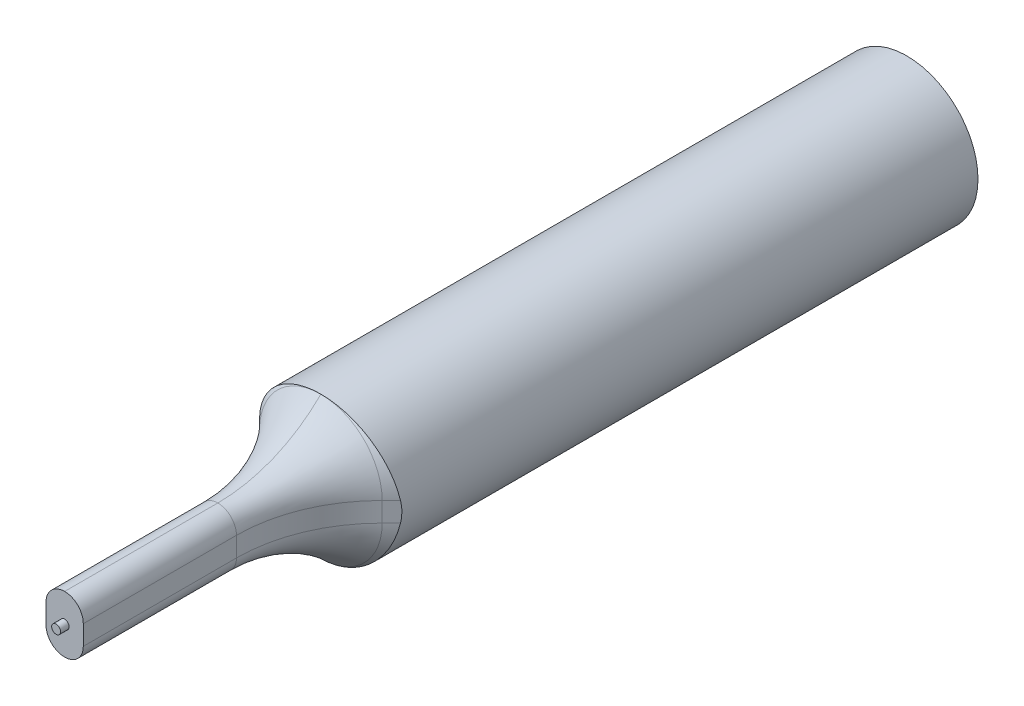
ISO-10303-21;
HEADER;
FILE_DESCRIPTION(('STEP AP214'),'2;1');
FILE_NAME('part.step','',(''),(''),'','','');
FILE_SCHEMA(('AUTOMOTIVE_DESIGN { 1 0 10303 214 1 1 1 1 }'));
ENDSEC;
DATA;
#1=APPLICATION_CONTEXT('core data for automotive mechanical design processes');
#2=APPLICATION_PROTOCOL_DEFINITION('international standard','automotive_design',2000,#1);
#3=PRODUCT_CONTEXT('',#1,'mechanical');
#4=PRODUCT('Part','Part','',(#3));
#5=PRODUCT_RELATED_PRODUCT_CATEGORY('part','',(#4));
#6=PRODUCT_DEFINITION_FORMATION('','',#4);
#7=PRODUCT_DEFINITION_CONTEXT('part definition',#1,'design');
#8=PRODUCT_DEFINITION('design','',#6,#7);
#9=PRODUCT_DEFINITION_SHAPE('','',#8);
#10=(LENGTH_UNIT() NAMED_UNIT(*) SI_UNIT(.MILLI.,.METRE.));
#11=(NAMED_UNIT(*) PLANE_ANGLE_UNIT() SI_UNIT($,.RADIAN.));
#12=(NAMED_UNIT(*) SI_UNIT($,.STERADIAN.) SOLID_ANGLE_UNIT());
#13=UNCERTAINTY_MEASURE_WITH_UNIT(LENGTH_MEASURE(1.E-05),#10,'distance_accuracy_value','');
#14=(GEOMETRIC_REPRESENTATION_CONTEXT(3) GLOBAL_UNCERTAINTY_ASSIGNED_CONTEXT((#13)) GLOBAL_UNIT_ASSIGNED_CONTEXT((#10,
#11,#12)) REPRESENTATION_CONTEXT('',''));
#15=CARTESIAN_POINT('',(0.,0.,0.));
#16=DIRECTION('',(0.,0.,1.));
#17=DIRECTION('',(1.,0.,0.));
#18=AXIS2_PLACEMENT_3D('',#15,#16,#17);
#19=CARTESIAN_POINT('',(0.,0.,43.5171681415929));
#20=DIRECTION('',(0.,0.,1.));
#21=DIRECTION('',(1.,0.,0.));
#22=AXIS2_PLACEMENT_3D('',#19,#20,#21);
#23=CYLINDRICAL_SURFACE('',#22,6.35);
#24=CARTESIAN_POINT('',(-5.92119806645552,-2.29388610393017,14.5772797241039));
#25=CARTESIAN_POINT('',(-5.92685944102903,-2.27926560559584,14.664229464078));
#26=CARTESIAN_POINT('',(-5.93180914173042,-2.26633597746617,14.7514987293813));
#27=CARTESIAN_POINT('',(-5.94033645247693,-2.2438922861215,14.9265393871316));
#28=CARTESIAN_POINT('',(-5.94391410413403,-2.23437811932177,15.0143107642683));
#29=CARTESIAN_POINT('',(-5.95266497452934,-2.21101194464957,15.2781402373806));
#30=CARTESIAN_POINT('',(-5.95585866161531,-2.20232951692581,15.4547537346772));
#31=CARTESIAN_POINT('',(-5.95713332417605,-2.19887735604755,15.808271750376));
#32=CARTESIAN_POINT('',(-5.95520968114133,-2.20412019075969,15.9851763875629));
#33=CARTESIAN_POINT('',(-5.94613941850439,-2.2284738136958,16.3378971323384));
#34=CARTESIAN_POINT('',(-5.93899290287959,-2.24758432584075,16.5137132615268));
#35=CARTESIAN_POINT('',(-5.91910627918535,-2.29944589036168,16.8631183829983));
#36=CARTESIAN_POINT('',(-5.90636256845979,-2.33220572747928,17.0367058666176));
#37=CARTESIAN_POINT('',(-5.87466187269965,-2.4109433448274,17.3802821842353));
#38=CARTESIAN_POINT('',(-5.85570495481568,-2.45692098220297,17.5502710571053));
#39=CARTESIAN_POINT('',(-5.81073647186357,-2.56145967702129,17.8852762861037));
#40=CARTESIAN_POINT('',(-5.78472884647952,-2.62001370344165,18.0502953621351));
#41=CARTESIAN_POINT('',(-5.72459450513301,-2.74892250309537,18.3741165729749));
#42=CARTESIAN_POINT('',(-5.69046940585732,-2.81927492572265,18.5329199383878));
#43=CARTESIAN_POINT('',(-5.61986464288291,-2.95710654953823,18.8149536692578));
#44=CARTESIAN_POINT('',(-5.58491850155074,-3.02281730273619,18.9394359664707));
#45=CARTESIAN_POINT('',(-5.50799919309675,-3.16080437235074,19.1824361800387));
#46=CARTESIAN_POINT('',(-5.4660273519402,-3.23307944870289,19.3009552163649));
#47=CARTESIAN_POINT('',(-5.37432201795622,-3.38332633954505,19.5310152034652));
#48=CARTESIAN_POINT('',(-5.32459680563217,-3.46129202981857,19.6425634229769));
#49=CARTESIAN_POINT('',(-5.21661165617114,-3.62199281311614,19.8577646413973));
#50=CARTESIAN_POINT('',(-5.15835353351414,-3.70472688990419,19.9614193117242));
#51=CARTESIAN_POINT('',(-4.99593631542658,-3.92312735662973,20.2175128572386));
#52=CARTESIAN_POINT('',(-4.88478345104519,-4.06160173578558,20.3632759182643));
#53=CARTESIAN_POINT('',(-4.63700310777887,-4.34230097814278,20.6273740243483));
#54=CARTESIAN_POINT('',(-4.50038307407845,-4.48452473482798,20.7457170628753));
#55=CARTESIAN_POINT('',(-4.27565364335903,-4.69596303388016,20.8989892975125));
#56=CARTESIAN_POINT('',(-4.19698126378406,-4.76648871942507,20.9462212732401));
#57=CARTESIAN_POINT('',(-4.03337301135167,-4.90570175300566,21.0316306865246));
#58=CARTESIAN_POINT('',(-3.9484405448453,-4.97439007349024,21.0698130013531));
#59=CARTESIAN_POINT('',(-3.77279273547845,-5.10889097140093,21.1364978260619));
#60=CARTESIAN_POINT('',(-3.68208130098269,-5.17470544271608,21.1650067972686));
#61=CARTESIAN_POINT('',(-3.49550107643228,-5.30252277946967,21.2118789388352));
#62=CARTESIAN_POINT('',(-3.39963330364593,-5.36452639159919,21.2302441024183));
#63=CARTESIAN_POINT('',(-3.21858077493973,-5.47473303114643,21.2544898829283));
#64=CARTESIAN_POINT('',(-3.13399371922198,-5.52359940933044,21.2618462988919));
#65=CARTESIAN_POINT('',(-2.96237292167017,-5.61750977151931,21.2689308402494));
#66=CARTESIAN_POINT('',(-2.87533843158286,-5.66255256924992,21.2686566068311));
#67=CARTESIAN_POINT('',(-2.69962249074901,-5.74839878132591,21.2604755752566));
#68=CARTESIAN_POINT('',(-2.61094216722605,-5.78920497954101,21.2525738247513));
#69=CARTESIAN_POINT('',(-2.4326256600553,-5.86636980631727,21.2292641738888));
#70=CARTESIAN_POINT('',(-2.34298912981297,-5.902726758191,21.2138534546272));
#71=CARTESIAN_POINT('',(-2.08553900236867,-6.0004230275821,21.1591250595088));
#72=CARTESIAN_POINT('',(-1.9173957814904,-6.05605791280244,21.1106667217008));
#73=CARTESIAN_POINT('',(-1.58524015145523,-6.15138004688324,20.9902758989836));
#74=CARTESIAN_POINT('',(-1.42122809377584,-6.19106594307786,20.918341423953));
#75=CARTESIAN_POINT('',(-1.088587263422,-6.25847170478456,20.7472192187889));
#76=CARTESIAN_POINT('',(-0.920593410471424,-6.28501921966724,20.6463455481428));
#77=CARTESIAN_POINT('',(-0.597190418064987,-6.32395902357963,20.4237842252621));
#78=CARTESIAN_POINT('',(-0.441791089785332,-6.33634037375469,20.30208057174));
#79=CARTESIAN_POINT('',(-0.187501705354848,-6.34812646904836,20.0777765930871));
#80=CARTESIAN_POINT('',(-0.0849723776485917,-6.35019396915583,19.9793689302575));
#81=CARTESIAN_POINT('',(0.111782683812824,-6.34977773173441,19.7745584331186));
#82=CARTESIAN_POINT('',(0.206005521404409,-6.34729241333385,19.668152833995));
#83=CARTESIAN_POINT('',(0.475713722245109,-6.33472006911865,19.3382514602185));
#84=CARTESIAN_POINT('',(0.638169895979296,-6.31951496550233,19.1041326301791));
#85=CARTESIAN_POINT('',(0.928257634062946,-6.28351284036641,18.6117275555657));
#86=CARTESIAN_POINT('',(1.05539044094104,-6.2626432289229,18.3531581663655));
#87=CARTESIAN_POINT('',(1.27161041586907,-6.22235044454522,17.8203731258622));
#88=CARTESIAN_POINT('',(1.36069139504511,-6.20292750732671,17.5461549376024));
#89=CARTESIAN_POINT('',(1.47178988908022,-6.17721932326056,17.1030731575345));
#90=CARTESIAN_POINT('',(1.50631693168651,-6.16881812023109,16.9373438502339));
#91=CARTESIAN_POINT('',(1.56221213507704,-6.154904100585,16.603492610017));
#92=CARTESIAN_POINT('',(1.58357746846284,-6.14939190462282,16.4353701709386));
#93=CARTESIAN_POINT('',(1.61312041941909,-6.14170742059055,16.0980450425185));
#94=CARTESIAN_POINT('',(1.62130870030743,-6.13953243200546,15.9288433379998));
#95=CARTESIAN_POINT('',(1.62453619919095,-6.13867960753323,15.5903682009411));
#96=CARTESIAN_POINT('',(1.61958144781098,-6.14000016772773,15.4210948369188));
#97=CARTESIAN_POINT('',(1.60032775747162,-6.14503963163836,15.1390605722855));
#98=CARTESIAN_POINT('',(1.58963793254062,-6.14782691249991,15.0260231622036));
#99=CARTESIAN_POINT('',(1.56236436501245,-6.15481026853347,14.8009072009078));
#100=CARTESIAN_POINT('',(1.54579100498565,-6.15900386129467,14.6888273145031));
#101=CARTESIAN_POINT('',(1.52626775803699,-6.16384674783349,14.5772797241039));
#102=B_SPLINE_CURVE_WITH_KNOTS('',3,(#24,#25,#26,#27,#28,#29,#30,#31,#32,#33,#34,#35,#36,#37,
#38,#39,#40,#41,#42,#43,#44,#45,#46,#47,#48,#49,#50,#51,#52,#53,#54,#55,#56,#57,#58,#59,#60,#61,
#62,#63,#64,#65,#66,#67,#68,#69,#70,#71,#72,#73,#74,#75,#76,#77,#78,#79,#80,#81,#82,#83,#84,#85,
#86,#87,#88,#89,#90,#91,#92,#93,#94,#95,#96,#97,#98,#99,#100,#101),.UNSPECIFIED.,.F.,.F.,(4,2,2,
2,2,2,2,2,2,2,2,2,2,2,2,2,2,2,2,2,2,2,2,2,2,2,2,2,2,2,2,2,2,2,2,2,2,2,4),(0.,0.265014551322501,
0.530021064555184,1.05991236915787,1.59028207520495,2.1206412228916,2.65134223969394,
3.18203752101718,3.71243687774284,4.24273068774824,4.67742509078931,5.11203754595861,
5.54618898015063,5.98024822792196,6.66667545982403,7.3529023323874,7.69964905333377,
8.04620846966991,8.39253594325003,8.73879534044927,9.03229993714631,9.32589526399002,
9.61929643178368,9.91280782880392,10.4610634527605,11.009365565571,11.6003612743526,
12.1918130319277,12.6176579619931,13.0436507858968,13.8959100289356,14.7596534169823,
15.6235372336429,16.1315475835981,16.6396670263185,17.1473750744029,17.6548502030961,
17.9954236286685,18.3353990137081),.UNSPECIFIED.);
#103=CARTESIAN_POINT('',(-5.9212110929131,-2.29385247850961,14.5774797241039));
#104=VERTEX_POINT('',#103);
#105=CARTESIAN_POINT('',(1.52630276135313,-6.16383808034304,14.5774797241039));
#106=VERTEX_POINT('',#105);
#107=EDGE_CURVE('E65',#104,#106,#102,.T.);
#108=ORIENTED_EDGE('',*,*,#107,.T.);
#109=CARTESIAN_POINT('',(1.52635511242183,-6.16382511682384,14.5776797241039));
#110=CARTESIAN_POINT('',(1.42396975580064,-6.18916413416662,14.18660833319));
#111=CARTESIAN_POINT('',(1.32068916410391,-6.21204658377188,13.7956089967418));
#112=CARTESIAN_POINT('',(1.11209743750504,-6.25276586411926,13.01384662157));
#113=CARTESIAN_POINT('',(1.00678609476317,-6.27060217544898,12.6230836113));
#114=CARTESIAN_POINT('',(0.793474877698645,-6.30115428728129,11.8403561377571));
#115=CARTESIAN_POINT('',(0.685465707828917,-6.31384867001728,11.4483933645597));
#116=CARTESIAN_POINT('',(0.466767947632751,-6.33377393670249,10.6651038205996));
#117=CARTESIAN_POINT('',(0.356079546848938,-6.34100520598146,10.273777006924));
#118=CARTESIAN_POINT('',(0.126364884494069,-6.34982899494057,9.47465869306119));
#119=CARTESIAN_POINT('',(0.00718664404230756,-6.3511568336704,9.06690779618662));
#120=CARTESIAN_POINT('',(-0.236063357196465,-6.34678061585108,8.25279047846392));
#121=CARTESIAN_POINT('',(-0.360136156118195,-6.34107505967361,7.84642437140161));
#122=CARTESIAN_POINT('',(-0.551430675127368,-6.32633219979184,7.23908602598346));
#123=CARTESIAN_POINT('',(-0.615995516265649,-6.32039578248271,7.03720040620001));
#124=CARTESIAN_POINT('',(-0.747338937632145,-6.3062157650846,6.63423413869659));
#125=CARTESIAN_POINT('',(-0.81411745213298,-6.29797223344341,6.4331534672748));
#126=CARTESIAN_POINT('',(-0.950478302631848,-6.27883983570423,6.03214796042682));
#127=CARTESIAN_POINT('',(-1.02005962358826,-6.26795192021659,5.8322227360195));
#128=CARTESIAN_POINT('',(-1.1629509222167,-6.24302186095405,5.43391533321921));
#129=CARTESIAN_POINT('',(-1.23626049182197,-6.22898006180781,5.23553298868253));
#130=CARTESIAN_POINT('',(-1.3652189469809,-6.20174230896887,4.90047757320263));
#131=CARTESIAN_POINT('',(-1.41953791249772,-6.18956506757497,4.76321207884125));
#132=CARTESIAN_POINT('',(-1.53153325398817,-6.16281037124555,4.4901914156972));
#133=CARTESIAN_POINT('',(-1.58921146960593,-6.14823159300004,4.35443712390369));
#134=CARTESIAN_POINT('',(-1.7090843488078,-6.11599462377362,4.08528915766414));
#135=CARTESIAN_POINT('',(-1.77127873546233,-6.09833662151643,3.95189533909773));
#136=CARTESIAN_POINT('',(-1.90206320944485,-6.05882418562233,3.68902720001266));
#137=CARTESIAN_POINT('',(-1.97064650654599,-6.03697418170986,3.55954890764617));
#138=CARTESIAN_POINT('',(-2.10333273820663,-5.99186254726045,3.33229045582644));
#139=CARTESIAN_POINT('',(-2.16565275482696,-5.96972871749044,3.23329403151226));
#140=CARTESIAN_POINT('',(-2.26642984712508,-5.93186755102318,3.0915698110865));
#141=CARTESIAN_POINT('',(-2.30113701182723,-5.9185118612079,3.04556964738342));
#142=CARTESIAN_POINT('',(-2.37368846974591,-5.88979058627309,2.95681554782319));
#143=CARTESIAN_POINT('',(-2.41152824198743,-5.87442787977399,2.91405709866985));
#144=CARTESIAN_POINT('',(-2.47961562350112,-5.84593359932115,2.84524426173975));
#145=CARTESIAN_POINT('',(-2.50886913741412,-5.83345327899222,2.8179493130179));
#146=CARTESIAN_POINT('',(-2.56976987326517,-5.80688287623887,2.76687069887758));
#147=CARTESIAN_POINT('',(-2.60142064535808,-5.79279038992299,2.74309240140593));
#148=CARTESIAN_POINT('',(-2.66772483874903,-5.76255928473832,2.70033534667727));
#149=CARTESIAN_POINT('',(-2.70241391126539,-5.74639492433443,2.68142797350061));
#150=CARTESIAN_POINT('',(-2.7740241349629,-5.71216634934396,2.65108246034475));
#151=CARTESIAN_POINT('',(-2.81093644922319,-5.69410946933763,2.63961663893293));
#152=CARTESIAN_POINT('',(-2.87633839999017,-5.66128629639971,2.62775964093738));
#153=CARTESIAN_POINT('',(-2.90461223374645,-5.64683417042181,2.62530878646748));
#154=CARTESIAN_POINT('',(-2.96089712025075,-5.61752555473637,2.62593215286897));
#155=CARTESIAN_POINT('',(-2.98890814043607,-5.6026690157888,2.62900704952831));
#156=CARTESIAN_POINT('',(-3.04373106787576,-5.57307544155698,2.64028786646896));
#157=CARTESIAN_POINT('',(-3.07054805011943,-5.55833817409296,2.64846928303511));
#158=CARTESIAN_POINT('',(-3.12266451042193,-5.52922775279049,2.66912591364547));
#159=CARTESIAN_POINT('',(-3.14796281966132,-5.51485488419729,2.68160438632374));
#160=CARTESIAN_POINT('',(-3.21497906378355,-5.47620563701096,2.72042366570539));
#161=CARTESIAN_POINT('',(-3.25500330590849,-5.4524663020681,2.75019138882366));
#162=CARTESIAN_POINT('',(-3.33047020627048,-5.40670211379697,2.81614957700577));
#163=CARTESIAN_POINT('',(-3.36589573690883,-5.38468378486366,2.85236292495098));
#164=CARTESIAN_POINT('',(-3.44628222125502,-5.33373411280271,2.94394434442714));
#165=CARTESIAN_POINT('',(-3.48947842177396,-5.30550979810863,3.00122630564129));
#166=CARTESIAN_POINT('',(-3.57068481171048,-5.25119873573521,3.12035990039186));
#167=CARTESIAN_POINT('',(-3.60868296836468,-5.22511700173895,3.18222164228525));
#168=CARTESIAN_POINT('',(-3.68100467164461,-5.1744240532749,3.30918822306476));
#169=CARTESIAN_POINT('',(-3.71530354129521,-5.14982314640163,3.37431104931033));
#170=CARTESIAN_POINT('',(-3.7808250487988,-5.10191115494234,3.50642041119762));
#171=CARTESIAN_POINT('',(-3.81205116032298,-5.07859862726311,3.5734047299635));
#172=CARTESIAN_POINT('',(-3.90848577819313,-5.00532201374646,3.79055854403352));
#173=CARTESIAN_POINT('',(-3.96912744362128,-4.9572180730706,3.94337224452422));
#174=CARTESIAN_POINT('',(-4.08300563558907,-4.86383852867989,4.25261185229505));
#175=CARTESIAN_POINT('',(-4.13623632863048,-4.81856516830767,4.40904049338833));
#176=CARTESIAN_POINT('',(-4.23746429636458,-4.72979269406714,4.72454171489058));
#177=CARTESIAN_POINT('',(-4.2854478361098,-4.68629841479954,4.88362003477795));
#178=CARTESIAN_POINT('',(-4.37730530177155,-4.60061216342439,5.20322980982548));
#179=CARTESIAN_POINT('',(-4.42118059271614,-4.55841976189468,5.36376076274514));
#180=CARTESIAN_POINT('',(-4.50573627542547,-4.4748606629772,5.68615655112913));
#181=CARTESIAN_POINT('',(-4.54641155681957,-4.43349536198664,5.84802308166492));
#182=CARTESIAN_POINT('',(-4.62506019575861,-4.35138402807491,6.17257780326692));
#183=CARTESIAN_POINT('',(-4.66303333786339,-4.31063804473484,6.33526605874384));
#184=CARTESIAN_POINT('',(-4.77342032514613,-4.18914803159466,6.82376858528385));
#185=CARTESIAN_POINT('',(-4.84242657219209,-4.10902715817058,7.15050850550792));
#186=CARTESIAN_POINT('',(-4.96709937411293,-3.95715585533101,7.77384603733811));
#187=CARTESIAN_POINT('',(-5.02341060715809,-3.88534541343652,8.07030213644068));
#188=CARTESIAN_POINT('',(-5.1312122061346,-3.74181890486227,8.66412028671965));
#189=CARTESIAN_POINT('',(-5.18270241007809,-3.67010284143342,8.96148236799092));
#190=CARTESIAN_POINT('',(-5.33097146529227,-3.4545278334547,9.85494974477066));
#191=CARTESIAN_POINT('',(-5.42146799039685,-3.31034189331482,10.452021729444));
#192=CARTESIAN_POINT('',(-5.58707169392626,-3.02227728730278,11.6371047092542));
#193=CARTESIAN_POINT('',(-5.66242009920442,-2.87843725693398,12.2250917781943));
#194=CARTESIAN_POINT('',(-5.76624907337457,-2.66069864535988,13.1073363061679));
#195=CARTESIAN_POINT('',(-5.79931221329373,-2.58782629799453,13.4013146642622));
#196=CARTESIAN_POINT('',(-5.86247393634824,-2.4413628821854,13.9894064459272));
#197=CARTESIAN_POINT('',(-5.89257256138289,-2.36777182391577,14.2835198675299));
#198=CARTESIAN_POINT('',(-5.9212305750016,-2.29380218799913,14.5776797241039));
#199=B_SPLINE_CURVE_WITH_KNOTS('',3,(#109,#110,#111,#112,#113,#114,#115,#116,#117,#118,#119,
#120,#121,#122,#123,#124,#125,#126,#127,#128,#129,#130,#131,#132,#133,#134,#135,#136,#137,#138,
#139,#140,#141,#142,#143,#144,#145,#146,#147,#148,#149,#150,#151,#152,#153,#154,#155,#156,#157,
#158,#159,#160,#161,#162,#163,#164,#165,#166,#167,#168,#169,#170,#171,#172,#173,#174,#175,#176,
#177,#178,#179,#180,#181,#182,#183,#184,#185,#186,#187,#188,#189,#190,#191,#192,#193,#194,#195,
#196,#197,#198),.UNSPECIFIED.,.F.,.F.,(4,2,2,2,2,2,2,2,2,2,2,2,2,2,2,2,2,2,2,2,2,2,2,2,2,2,2,2,
2,2,2,2,2,2,2,2,2,2,2,2,2,2,2,2,4),(0.,1.21513178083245,2.43038859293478,3.65065653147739,
4.87083839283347,6.14520896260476,7.41985129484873,8.05595690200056,8.69204363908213,
9.32790205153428,9.96369101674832,10.4080146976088,10.8525840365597,11.2971261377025,
11.7412010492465,12.0977164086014,12.2750382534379,12.4521085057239,12.5776622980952,
12.7034058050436,12.8308989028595,12.9579149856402,13.0529950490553,13.1480867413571,
13.2427256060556,13.3374363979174,13.5021919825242,13.6675445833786,13.8982470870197,
14.1294749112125,14.3621605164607,14.5945799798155,15.108044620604,15.6219111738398,
16.1370921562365,16.6521013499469,17.1679169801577,17.6837736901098,18.7139312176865,
19.6444424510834,20.5749849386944,22.4373710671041,24.2672221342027,25.1812335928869,
26.0952321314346),.UNSPECIFIED.);
#200=EDGE_CURVE('E11',#106,#104,#199,.T.);
#201=ORIENTED_EDGE('',*,*,#200,.T.);
#202=EDGE_LOOP('',(#108,#201));
#203=FACE_BOUND('',#202,.T.);
#204=CARTESIAN_POINT('',(0.,0.,52.9729685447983));
#205=DIRECTION('',(0.707106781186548,0.,-0.707106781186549));
#206=DIRECTION('',(0.707106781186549,0.,0.707106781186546));
#207=AXIS2_PLACEMENT_3D('',#204,#205,#206);
#208=ELLIPSE('',#207,8.98025612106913,6.35);
#209=CARTESIAN_POINT('',(-6.28942147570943,-0.875030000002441,46.6835470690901));
#210=VERTEX_POINT('',#209);
#211=CARTESIAN_POINT('',(-6.28942147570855,0.875029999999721,46.6835470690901));
#212=VERTEX_POINT('',#211);
#213=EDGE_CURVE('E156',#210,#212,#208,.T.);
#214=ORIENTED_EDGE('',*,*,#213,.T.);
#215=CARTESIAN_POINT('',(-6.28944929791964,0.874829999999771,46.6835192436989));
#216=CARTESIAN_POINT('',(-6.26821941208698,1.0275291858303,46.7047629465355));
#217=CARTESIAN_POINT('',(-6.24141002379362,1.17945045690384,46.7260076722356));
#218=CARTESIAN_POINT('',(-6.17681584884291,1.4809378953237,46.7683820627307));
#219=CARTESIAN_POINT('',(-6.13903242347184,1.63050435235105,46.7895117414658));
#220=CARTESIAN_POINT('',(-6.05263882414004,1.92662260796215,46.8315586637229));
#221=CARTESIAN_POINT('',(-6.00402124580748,2.07317226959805,46.8524757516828));
#222=CARTESIAN_POINT('',(-5.89621996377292,2.36239524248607,46.8939657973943));
#223=CARTESIAN_POINT('',(-5.83703512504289,2.5050681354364,46.9145387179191));
#224=CARTESIAN_POINT('',(-5.6976395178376,2.80924690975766,46.9586198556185));
#225=CARTESIAN_POINT('',(-5.61556790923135,2.96991622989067,46.9820441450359));
#226=CARTESIAN_POINT('',(-5.43796213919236,3.28384051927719,47.0280724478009));
#227=CARTESIAN_POINT('',(-5.34242229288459,3.43709232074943,47.050676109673));
#228=CARTESIAN_POINT('',(-5.1385867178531,3.7349680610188,47.0948525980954));
#229=CARTESIAN_POINT('',(-5.03029416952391,3.87959413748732,47.1164256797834));
#230=CARTESIAN_POINT('',(-4.80168286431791,4.15920102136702,47.15835198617));
#231=CARTESIAN_POINT('',(-4.68136393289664,4.29418168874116,47.1787051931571));
#232=CARTESIAN_POINT('',(-4.430235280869,4.55278167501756,47.217890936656));
#233=CARTESIAN_POINT('',(-4.29948701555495,4.67645949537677,47.2367312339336));
#234=CARTESIAN_POINT('',(-4.02783871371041,4.9123697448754,47.2728315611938));
#235=CARTESIAN_POINT('',(-3.88693867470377,5.0246021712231,47.2900915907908));
#236=CARTESIAN_POINT('',(-3.59593098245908,5.23681399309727,47.3228616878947));
#237=CARTESIAN_POINT('',(-3.44582031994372,5.33678935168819,47.3383711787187));
#238=CARTESIAN_POINT('',(-3.13750658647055,5.52368056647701,47.3674697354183));
#239=CARTESIAN_POINT('',(-2.97930379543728,5.61059687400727,47.3810588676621));
#240=CARTESIAN_POINT('',(-2.65753461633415,5.76991523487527,47.4060453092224));
#241=CARTESIAN_POINT('',(-2.49403638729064,5.84245178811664,47.4174628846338));
#242=CARTESIAN_POINT('',(-2.16144855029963,5.97348913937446,47.4381406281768));
#243=CARTESIAN_POINT('',(-1.99236115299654,6.03199541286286,47.447401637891));
#244=CARTESIAN_POINT('',(-1.64993666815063,6.13450230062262,47.4636585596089));
#245=CARTESIAN_POINT('',(-1.4766042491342,6.17851814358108,47.4706568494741));
#246=CARTESIAN_POINT('',(-1.12683749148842,6.25177111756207,47.4823185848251));
#247=CARTESIAN_POINT('',(-0.950404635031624,6.2810151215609,47.4869831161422));
#248=CARTESIAN_POINT('',(-0.644717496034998,6.31850948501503,47.492967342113));
#249=CARTESIAN_POINT('',(-0.515900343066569,6.33032817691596,47.494855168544));
#250=CARTESIAN_POINT('',(-0.257992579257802,6.34607074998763,47.4973705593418));
#251=CARTESIAN_POINT('',(-0.128902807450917,6.35000803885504,47.4980002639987));
#252=CARTESIAN_POINT('',(0.000199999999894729,6.34999999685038,47.4979985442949));
#253=B_SPLINE_CURVE_WITH_KNOTS('',3,(#215,#216,#217,#218,#219,#220,#221,#222,#223,#224,#225,
#226,#227,#228,#229,#230,#231,#232,#233,#234,#235,#236,#237,#238,#239,#240,#241,#242,#243,#244,
#245,#246,#247,#248,#249,#250,#251,#252),.UNSPECIFIED.,.F.,.F.,(4,2,2,2,2,2,2,2,2,2,2,2,2,2,2,2,
2,2,4),(0.,0.466769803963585,0.933481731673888,1.40051360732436,1.86759567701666,
2.41272364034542,2.95808239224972,3.5033054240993,4.04853637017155,4.59076317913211,
5.13299012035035,5.67539517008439,6.21778146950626,6.75482664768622,7.29166189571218,
7.82793114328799,8.36395064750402,8.75183188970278,9.13905271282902),.UNSPECIFIED.);
#254=CARTESIAN_POINT('',(0.,6.34999999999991,47.4979985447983));
#255=VERTEX_POINT('',#254);
#256=EDGE_CURVE('E213',#212,#255,#253,.T.);
#257=ORIENTED_EDGE('',*,*,#256,.T.);
#258=CARTESIAN_POINT('',(-0.000200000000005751,6.34999999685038,47.4979985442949));
#259=CARTESIAN_POINT('',(0.176360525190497,6.35002569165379,47.4980042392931));
#260=CARTESIAN_POINT('',(0.352917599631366,6.34264813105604,47.4968235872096));
#261=CARTESIAN_POINT('',(0.70476185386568,6.3132324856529,47.4921244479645));
#262=CARTESIAN_POINT('',(0.880049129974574,6.29119552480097,47.4886061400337));
#263=CARTESIAN_POINT('',(1.22793484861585,6.23263789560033,47.4792714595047));
#264=CARTESIAN_POINT('',(1.40053593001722,6.19613251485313,47.4734575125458));
#265=CARTESIAN_POINT('',(1.74201893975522,6.10892127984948,47.4595987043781));
#266=CARTESIAN_POINT('',(1.9109008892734,6.05821550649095,47.4515538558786));
#267=CARTESIAN_POINT('',(2.24389774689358,5.94293645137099,47.4333146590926));
#268=CARTESIAN_POINT('',(2.40800866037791,5.87835190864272,47.4231185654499));
#269=CARTESIAN_POINT('',(2.7302360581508,5.73579641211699,47.4006875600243));
#270=CARTESIAN_POINT('',(2.88835032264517,5.65782055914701,47.388451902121));
#271=CARTESIAN_POINT('',(3.19737464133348,5.48910510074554,47.3620784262));
#272=CARTESIAN_POINT('',(3.34828724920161,5.39837006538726,47.3479412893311));
#273=CARTESIAN_POINT('',(3.64194340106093,5.20477453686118,47.3179057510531));
#274=CARTESIAN_POINT('',(3.78468668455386,5.10191365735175,47.3020072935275));
#275=CARTESIAN_POINT('',(4.06213569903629,4.88394536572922,47.2684735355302));
#276=CARTESIAN_POINT('',(4.19676847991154,4.76874706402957,47.2508254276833));
#277=CARTESIAN_POINT('',(4.45583722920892,4.52761859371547,47.2140701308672));
#278=CARTESIAN_POINT('',(4.58027315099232,4.40168837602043,47.1949629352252));
#279=CARTESIAN_POINT('',(4.81817650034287,4.13992412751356,47.1554560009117));
#280=CARTESIAN_POINT('',(4.93163793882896,4.00408475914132,47.1350555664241));
#281=CARTESIAN_POINT('',(5.14675754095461,3.72352448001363,47.09315348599));
#282=CARTESIAN_POINT('',(5.24841582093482,3.57880365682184,47.0716518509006));
#283=CARTESIAN_POINT('',(5.4404115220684,3.27969286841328,47.0274650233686));
#284=CARTESIAN_POINT('',(5.530597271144,3.12520718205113,47.0047686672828));
#285=CARTESIAN_POINT('',(5.69755089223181,2.80932639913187,46.9586340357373));
#286=CARTESIAN_POINT('',(5.77432359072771,2.64793381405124,46.9351960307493));
#287=CARTESIAN_POINT('',(5.91388835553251,2.31953048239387,46.887788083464));
#288=CARTESIAN_POINT('',(5.97669731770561,2.15252681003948,46.8638188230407));
#289=CARTESIAN_POINT('',(6.08800772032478,1.81394421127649,46.8155137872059));
#290=CARTESIAN_POINT('',(6.13651637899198,1.64236764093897,46.7911782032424));
#291=CARTESIAN_POINT('',(6.20106716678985,1.37093261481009,46.7529078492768));
#292=CARTESIAN_POINT('',(6.22206878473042,1.27221853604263,46.739036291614));
#293=CARTESIAN_POINT('',(6.25931654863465,1.07405940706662,46.7112833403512));
#294=CARTESIAN_POINT('',(6.27556998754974,0.974615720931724,46.6974019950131));
#295=CARTESIAN_POINT('',(6.28944929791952,0.874829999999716,46.6835192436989));
#296=B_SPLINE_CURVE_WITH_KNOTS('',3,(#258,#259,#260,#261,#262,#263,#264,#265,#266,#267,#268,
#269,#270,#271,#272,#273,#274,#275,#276,#277,#278,#279,#280,#281,#282,#283,#284,#285,#286,#287,
#288,#289,#290,#291,#292,#293,#294,#295),.UNSPECIFIED.,.F.,.F.,(4,2,2,2,2,2,2,2,2,2,2,2,2,2,2,2,
2,2,4),(0.,0.529517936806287,1.05899527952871,1.58791465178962,2.116831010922,2.64617815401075,
3.1757193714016,3.7050713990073,4.23444029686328,4.76801920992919,5.30160056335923,
5.83547148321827,6.36933714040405,6.90965505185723,7.44977813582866,7.98924408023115,
8.52843725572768,8.83395232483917,9.13899564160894),.UNSPECIFIED.);
#297=CARTESIAN_POINT('',(6.28942147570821,0.875029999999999,46.6835470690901));
#298=VERTEX_POINT('',#297);
#299=EDGE_CURVE('E162',#255,#298,#296,.T.);
#300=ORIENTED_EDGE('',*,*,#299,.T.);
#301=CARTESIAN_POINT('',(0.,0.,52.9729685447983));
#302=DIRECTION('',(-0.707106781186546,0.,-0.707106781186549));
#303=DIRECTION('',(-0.707106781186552,0.,0.707106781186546));
#304=AXIS2_PLACEMENT_3D('',#301,#302,#303);
#305=ELLIPSE('',#304,8.98025612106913,6.35);
#306=CARTESIAN_POINT('',(6.28942147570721,-0.875030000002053,46.6835470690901));
#307=VERTEX_POINT('',#306);
#308=EDGE_CURVE('E169',#298,#307,#305,.T.);
#309=ORIENTED_EDGE('',*,*,#308,.T.);
#310=CARTESIAN_POINT('',(6.28944929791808,-0.874830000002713,46.6835192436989));
#311=CARTESIAN_POINT('',(6.26821940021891,-1.02752927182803,46.7047629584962));
#312=CARTESIAN_POINT('',(6.24140999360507,-1.17945062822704,46.7260076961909));
#313=CARTESIAN_POINT('',(6.17681577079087,-1.48093822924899,46.7683821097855));
#314=CARTESIAN_POINT('',(6.13903231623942,-1.63050476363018,46.7895117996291));
#315=CARTESIAN_POINT('',(6.0526386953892,-1.92662300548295,46.8315587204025));
#316=CARTESIAN_POINT('',(6.0040211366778,-2.0731725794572,46.8524757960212));
#317=CARTESIAN_POINT('',(5.89621990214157,-2.36239539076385,46.8939658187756));
#318=CARTESIAN_POINT('',(5.83703509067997,-2.50506820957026,46.9145387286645));
#319=CARTESIAN_POINT('',(5.69764127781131,-2.80924307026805,46.9586192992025));
#320=CARTESIAN_POINT('',(5.61557175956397,-2.96990869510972,46.9820430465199));
#321=CARTESIAN_POINT('',(5.43797067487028,-3.28382616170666,47.0280703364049));
#322=CARTESIAN_POINT('',(5.34243340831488,-3.43707482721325,47.0506735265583));
#323=CARTESIAN_POINT('',(5.13861704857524,-3.73492498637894,47.0948461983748));
#324=CARTESIAN_POINT('',(5.03034282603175,-3.87952975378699,47.116416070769));
#325=CARTESIAN_POINT('',(4.80173110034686,-4.15914689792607,47.1583438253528));
#326=CARTESIAN_POINT('',(4.68138915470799,-4.29415571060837,47.1787012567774));
#327=CARTESIAN_POINT('',(4.43024123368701,-4.55277555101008,47.2178900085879));
#328=CARTESIAN_POINT('',(4.29949947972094,-4.67644771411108,47.2367294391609));
#329=CARTESIAN_POINT('',(4.02781474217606,-4.91239151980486,47.2728348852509));
#330=CARTESIAN_POINT('',(3.88686799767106,-5.02465892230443,47.2901003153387));
#331=CARTESIAN_POINT('',(3.59585746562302,-5.23686239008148,47.322869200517));
#332=CARTESIAN_POINT('',(3.44579671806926,-5.33680253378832,47.338373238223));
#333=CARTESIAN_POINT('',(3.13752643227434,-5.52366966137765,47.3674680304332));
#334=CARTESIAN_POINT('',(2.97931393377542,-5.61059187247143,47.3810580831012));
#335=CARTESIAN_POINT('',(2.65770572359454,-5.76983049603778,47.4060320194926));
#336=CARTESIAN_POINT('',(2.49438589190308,-5.8422966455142,47.4174384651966));
#337=CARTESIAN_POINT('',(2.16204040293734,-5.97327334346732,47.4381065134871));
#338=CARTESIAN_POINT('',(1.99301267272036,-6.0317787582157,47.447367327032));
#339=CARTESIAN_POINT('',(1.6505744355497,-6.13433290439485,47.4636316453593));
#340=CARTESIAN_POINT('',(1.47716522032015,-6.17838584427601,47.4706358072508));
#341=CARTESIAN_POINT('',(1.12716967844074,-6.25171631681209,47.4823098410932));
#342=CARTESIAN_POINT('',(0.950583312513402,-6.28099366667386,47.4869796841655));
#343=CARTESIAN_POINT('',(0.59738311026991,-6.32431487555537,47.493893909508));
#344=CARTESIAN_POINT('',(0.42078890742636,-6.33851497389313,47.4961631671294));
#345=CARTESIAN_POINT('',(0.0670176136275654,-6.35211325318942,47.4983361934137));
#346=CARTESIAN_POINT('',(-0.110159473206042,-6.3515115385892,47.4982399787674));
#347=CARTESIAN_POINT('',(-0.463824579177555,-6.33551105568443,47.4956832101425));
#348=CARTESIAN_POINT('',(-0.640312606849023,-6.32011247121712,47.4932226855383));
#349=CARTESIAN_POINT('',(-0.99133505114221,-6.27463746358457,47.4859658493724));
#350=CARTESIAN_POINT('',(-1.16586950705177,-6.24456133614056,47.4811695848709));
#351=CARTESIAN_POINT('',(-1.51111931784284,-6.17009658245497,47.469317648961));
#352=CARTESIAN_POINT('',(-1.68184617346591,-6.12575995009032,47.462270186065));
#353=CARTESIAN_POINT('',(-2.01886508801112,-6.02309745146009,47.4459927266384));
#354=CARTESIAN_POINT('',(-2.18515873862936,-5.96477668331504,47.4367635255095));
#355=CARTESIAN_POINT('',(-2.51227751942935,-5.83454925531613,47.4162184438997));
#356=CARTESIAN_POINT('',(-2.67310055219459,-5.76263745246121,47.4049017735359));
#357=CARTESIAN_POINT('',(-2.98804305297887,-5.60580364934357,47.3803094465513));
#358=CARTESIAN_POINT('',(-3.1421648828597,-5.52088628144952,47.3670344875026));
#359=CARTESIAN_POINT('',(-3.44357950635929,-5.33811790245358,47.338578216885));
#360=CARTESIAN_POINT('',(-3.59082776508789,-5.24019509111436,47.3233863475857));
#361=CARTESIAN_POINT('',(-3.8764791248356,-5.03255175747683,47.2913167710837));
#362=CARTESIAN_POINT('',(-4.0148853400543,-4.92283542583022,47.2744396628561));
#363=CARTESIAN_POINT('',(-4.2820333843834,-4.69231614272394,47.2391518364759));
#364=CARTESIAN_POINT('',(-4.41077083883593,-4.57150822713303,47.22074043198));
#365=CARTESIAN_POINT('',(-4.65760533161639,-4.31975454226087,47.1825702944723));
#366=CARTESIAN_POINT('',(-4.77570609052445,-4.18881234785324,47.1628120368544));
#367=CARTESIAN_POINT('',(-5.00182988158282,-3.91611173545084,47.1218857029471));
#368=CARTESIAN_POINT('',(-5.10972121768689,-3.77424613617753,47.1007040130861));
#369=CARTESIAN_POINT('',(-5.3131032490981,-3.48211177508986,47.0573330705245));
#370=CARTESIAN_POINT('',(-5.40859824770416,-3.33184595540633,47.0351441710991));
#371=CARTESIAN_POINT('',(-5.58657857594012,-3.02394562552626,46.9899424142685));
#372=CARTESIAN_POINT('',(-5.66906620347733,-2.86631242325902,46.9669297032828));
#373=CARTESIAN_POINT('',(-5.8204769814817,-2.54482400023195,46.9202726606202));
#374=CARTESIAN_POINT('',(-5.88940338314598,-2.3809702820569,46.8966284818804));
#375=CARTESIAN_POINT('',(-6.03188982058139,-1.99802383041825,46.8416980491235));
#376=CARTESIAN_POINT('',(-6.10062071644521,-1.77712483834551,46.8102499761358));
#377=CARTESIAN_POINT('',(-6.18530067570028,-1.44148346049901,46.7628360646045));
#378=CARTESIAN_POINT('',(-6.21044824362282,-1.32895711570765,46.7470008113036));
#379=CARTESIAN_POINT('',(-6.25458132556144,-1.1027167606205,46.7152845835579));
#380=CARTESIAN_POINT('',(-6.27356725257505,-0.989002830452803,46.6994036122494));
#381=CARTESIAN_POINT('',(-6.2894492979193,-0.874830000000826,46.6835192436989));
#382=B_SPLINE_CURVE_WITH_KNOTS('',3,(#310,#311,#312,#313,#314,#315,#316,#317,#318,#319,#320,
#321,#322,#323,#324,#325,#326,#327,#328,#329,#330,#331,#332,#333,#334,#335,#336,#337,#338,#339,
#340,#341,#342,#343,#344,#345,#346,#347,#348,#349,#350,#351,#352,#353,#354,#355,#356,#357,#358,
#359,#360,#361,#362,#363,#364,#365,#366,#367,#368,#369,#370,#371,#372,#373,#374,#375,#376,#377,
#378,#379,#380,#381),.UNSPECIFIED.,.F.,.F.,(4,2,2,2,2,2,2,2,2,2,2,2,2,2,2,2,2,2,2,2,2,2,2,2,2,2,
2,2,2,2,2,2,2,2,2,4),(0.,0.466770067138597,0.933482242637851,1.40051384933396,1.86759567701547,
2.41271086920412,2.95805747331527,3.50319620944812,4.04853636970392,4.59073739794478,
5.13313927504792,5.67536121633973,6.21778146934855,6.75425258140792,7.29092066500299,
7.82743233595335,8.36395064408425,8.89485329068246,9.42575219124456,9.9566444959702,
10.4875261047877,11.0164936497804,11.5452686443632,12.0742441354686,12.6030316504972,
13.1348702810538,13.6665205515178,14.1984099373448,14.7301125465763,15.267937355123,
15.8055749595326,16.3431174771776,16.8805309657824,17.5794003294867,17.9284116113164,
18.2773994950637),.UNSPECIFIED.);
#383=EDGE_CURVE('E204',#307,#210,#382,.T.);
#384=ORIENTED_EDGE('',*,*,#383,.T.);
#385=EDGE_LOOP('',(#214,#257,#300,#309,#384));
#386=FACE_BOUND('',#385,.T.);
#387=CARTESIAN_POINT('',(0.,0.,-4.77519999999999));
#388=DIRECTION('',(0.,0.,1.));
#389=DIRECTION('',(1.,0.,0.));
#390=AXIS2_PLACEMENT_3D('',#387,#388,#389);
#391=CIRCLE('',#390,6.35);
#392=CARTESIAN_POINT('',(6.35000000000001,0.,-4.77519999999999));
#393=VERTEX_POINT('',#392);
#394=EDGE_CURVE('E159',#393,#393,#391,.T.);
#395=ORIENTED_EDGE('',*,*,#394,.T.);
#396=EDGE_LOOP('',(#395));
#397=FACE_BOUND('',#396,.T.);
#398=ADVANCED_FACE('F51',(#203,#386,#397),#23,.T.);
#399=CARTESIAN_POINT('',(-6.35000000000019,-4.44089209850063E-13,-4.77519999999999));
#400=DIRECTION('',(0.,0.,1.));
#401=DIRECTION('',(1.,0.,0.));
#402=AXIS2_PLACEMENT_3D('',#399,#400,#401);
#403=PLANE('',#402);
#404=ORIENTED_EDGE('',*,*,#394,.F.);
#405=EDGE_LOOP('',(#404));
#406=FACE_BOUND('',#405,.T.);
#407=ADVANCED_FACE('F151',(#406),#403,.F.);
#408=CARTESIAN_POINT('',(-1.11022302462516E-13,0.875029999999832,47.5016567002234));
#409=DIRECTION('',(0.,0.,-1.));
#410=DIRECTION('',(-1.,0.,0.));
#411=AXIS2_PLACEMENT_3D('',#408,#409,#410);
#412=CONICAL_SURFACE('',#411,5.47131184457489,0.78539816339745);
#413=DIRECTION('',(-0.707106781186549,0.,-0.707106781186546));
#414=VECTOR('',#413,1.);
#415=CARTESIAN_POINT('',(-5.47131184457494,0.875029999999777,47.5016567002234));
#416=LINE('',#415,#414);
#417=CARTESIAN_POINT('',(-5.47131184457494,0.875029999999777,47.5016567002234));
#418=VERTEX_POINT('',#417);
#419=EDGE_CURVE('E174',#418,#212,#416,.T.);
#420=ORIENTED_EDGE('',*,*,#419,.F.);
#421=CARTESIAN_POINT('',(-1.11022302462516E-13,0.875029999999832,47.5016567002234));
#422=DIRECTION('',(0.,0.,-1.));
#423=DIRECTION('',(-1.,0.,0.));
#424=AXIS2_PLACEMENT_3D('',#421,#422,#423);
#425=CIRCLE('',#424,5.47131184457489);
#426=CARTESIAN_POINT('',(-1.22124532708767E-12,6.34634184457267,47.5016567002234));
#427=VERTEX_POINT('',#426);
#428=EDGE_CURVE('E163',#418,#427,#425,.T.);
#429=ORIENTED_EDGE('',*,*,#428,.T.);
#430=DIRECTION('',(0.,0.707106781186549,-0.707106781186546));
#431=VECTOR('',#430,1.);
#432=CARTESIAN_POINT('',(-1.22124532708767E-12,6.34634184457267,47.5016567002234));
#433=LINE('',#432,#431);
#434=EDGE_CURVE('E420',#427,#255,#433,.T.);
#435=ORIENTED_EDGE('',*,*,#434,.T.);
#436=ORIENTED_EDGE('',*,*,#256,.F.);
#437=EDGE_LOOP('',(#420,#429,#435,#436));
#438=FACE_BOUND('',#437,.T.);
#439=ADVANCED_FACE('F220',(#438),#412,.T.);
#440=CARTESIAN_POINT('',(-5.47131184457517,-0.875030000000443,47.5016567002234));
#441=DIRECTION('',(0.707106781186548,0.,-0.707106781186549));
#442=DIRECTION('',(-0.707106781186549,0.,-0.707106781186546));
#443=AXIS2_PLACEMENT_3D('',#440,#441,#442);
#444=PLANE('',#443);
#445=DIRECTION('',(-0.707106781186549,0.,-0.707106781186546));
#446=VECTOR('',#445,1.);
#447=CARTESIAN_POINT('',(-5.47131184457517,-0.875030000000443,47.5016567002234));
#448=LINE('',#447,#446);
#449=CARTESIAN_POINT('',(-5.47131184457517,-0.875030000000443,47.5016567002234));
#450=VERTEX_POINT('',#449);
#451=EDGE_CURVE('E437',#450,#210,#448,.T.);
#452=ORIENTED_EDGE('',*,*,#451,.F.);
#453=DIRECTION('',(0.,1.,0.));
#454=VECTOR('',#453,1.);
#455=CARTESIAN_POINT('',(-5.47131184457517,-0.875030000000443,47.5016567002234));
#456=LINE('',#455,#454);
#457=EDGE_CURVE('E500',#450,#418,#456,.T.);
#458=ORIENTED_EDGE('',*,*,#457,.T.);
#459=ORIENTED_EDGE('',*,*,#419,.T.);
#460=ORIENTED_EDGE('',*,*,#213,.F.);
#461=EDGE_LOOP('',(#452,#458,#459,#460));
#462=FACE_BOUND('',#461,.T.);
#463=ADVANCED_FACE('F201',(#462),#444,.F.);
#464=CARTESIAN_POINT('',(-1.22124532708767E-12,-0.875030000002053,47.5016567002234));
#465=DIRECTION('',(0.,0.,-1.));
#466=DIRECTION('',(-1.,0.,0.));
#467=AXIS2_PLACEMENT_3D('',#464,#465,#466);
#468=CONICAL_SURFACE('',#467,5.47131184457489,0.78539816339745);
#469=DIRECTION('',(0.707106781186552,0.,-0.707106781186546));
#470=VECTOR('',#469,1.);
#471=CARTESIAN_POINT('',(5.47131184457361,-0.875030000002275,47.5016567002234));
#472=LINE('',#471,#470);
#473=CARTESIAN_POINT('',(5.47131184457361,-0.875030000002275,47.5016567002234));
#474=VERTEX_POINT('',#473);
#475=EDGE_CURVE('E431',#474,#307,#472,.T.);
#476=ORIENTED_EDGE('',*,*,#475,.F.);
#477=CARTESIAN_POINT('',(-1.22124532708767E-12,-0.875030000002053,47.5016567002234));
#478=DIRECTION('',(0.,0.,-1.));
#479=DIRECTION('',(1.,0.,0.));
#480=AXIS2_PLACEMENT_3D('',#477,#478,#479);
#481=CIRCLE('',#480,5.47131184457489);
#482=EDGE_CURVE('E462',#474,#450,#481,.T.);
#483=ORIENTED_EDGE('',*,*,#482,.T.);
#484=ORIENTED_EDGE('',*,*,#451,.T.);
#485=ORIENTED_EDGE('',*,*,#383,.F.);
#486=EDGE_LOOP('',(#476,#483,#484,#485));
#487=FACE_BOUND('',#486,.T.);
#488=ADVANCED_FACE('F196',(#487),#468,.T.);
#489=CARTESIAN_POINT('',(5.47131184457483,0.875029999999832,47.5016567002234));
#490=DIRECTION('',(-0.707106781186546,0.,-0.707106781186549));
#491=DIRECTION('',(-0.707106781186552,0.,0.707106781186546));
#492=AXIS2_PLACEMENT_3D('',#489,#490,#491);
#493=PLANE('',#492);
#494=DIRECTION('',(0.707106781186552,0.,-0.707106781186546));
#495=VECTOR('',#494,1.);
#496=CARTESIAN_POINT('',(5.47131184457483,0.875029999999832,47.5016567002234));
#497=LINE('',#496,#495);
#498=CARTESIAN_POINT('',(5.47131184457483,0.875029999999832,47.5016567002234));
#499=VERTEX_POINT('',#498);
#500=EDGE_CURVE('E426',#499,#298,#497,.T.);
#501=ORIENTED_EDGE('',*,*,#500,.F.);
#502=DIRECTION('',(0.,-1.,0.));
#503=VECTOR('',#502,1.);
#504=CARTESIAN_POINT('',(5.47131184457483,0.875029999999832,47.5016567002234));
#505=LINE('',#504,#503);
#506=EDGE_CURVE('E488',#499,#474,#505,.T.);
#507=ORIENTED_EDGE('',*,*,#506,.T.);
#508=ORIENTED_EDGE('',*,*,#475,.T.);
#509=ORIENTED_EDGE('',*,*,#308,.F.);
#510=EDGE_LOOP('',(#501,#507,#508,#509));
#511=FACE_BOUND('',#510,.T.);
#512=ADVANCED_FACE('F191',(#511),#493,.F.);
#513=CARTESIAN_POINT('',(-1.11022302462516E-13,0.875029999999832,47.5016567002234));
#514=DIRECTION('',(0.,0.,-1.));
#515=DIRECTION('',(-1.,0.,0.));
#516=AXIS2_PLACEMENT_3D('',#513,#514,#515);
#517=CONICAL_SURFACE('',#516,5.4713118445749,0.78539816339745);
#518=ORIENTED_EDGE('',*,*,#434,.F.);
#519=CARTESIAN_POINT('',(-1.11022302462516E-13,0.875029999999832,47.5016567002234));
#520=DIRECTION('',(0.,0.,-1.));
#521=DIRECTION('',(0.,1.,0.));
#522=AXIS2_PLACEMENT_3D('',#519,#520,#521);
#523=CIRCLE('',#522,5.47131184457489);
#524=EDGE_CURVE('E481',#427,#499,#523,.T.);
#525=ORIENTED_EDGE('',*,*,#524,.T.);
#526=ORIENTED_EDGE('',*,*,#500,.T.);
#527=ORIENTED_EDGE('',*,*,#299,.F.);
#528=EDGE_LOOP('',(#518,#525,#526,#527));
#529=FACE_BOUND('',#528,.T.);
#530=ADVANCED_FACE('F185',(#529),#517,.T.);
#531=CARTESIAN_POINT('',(-1.11022302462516E-13,0.875029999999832,56.6940448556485));
#532=DIRECTION('',(0.,0.,-1.));
#533=DIRECTION('',(-1.,0.,0.));
#534=AXIS2_PLACEMENT_3D('',#531,#532,#533);
#535=TOROIDAL_SURFACE('',#534,14.6637,13.);
#536=CARTESIAN_POINT('',(-1.11022302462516E-13,0.875029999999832,56.6940448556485));
#537=DIRECTION('',(0.,0.,-1.));
#538=DIRECTION('',(-1.,0.,0.));
#539=AXIS2_PLACEMENT_3D('',#536,#537,#538);
#540=CIRCLE('',#539,1.6637);
#541=CARTESIAN_POINT('',(-1.66370000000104,0.875029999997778,56.6940448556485));
#542=VERTEX_POINT('',#541);
#543=CARTESIAN_POINT('',(0.,2.53872999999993,56.6940448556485));
#544=VERTEX_POINT('',#543);
#545=EDGE_CURVE('E171',#542,#544,#540,.T.);
#546=ORIENTED_EDGE('',*,*,#545,.T.);
#547=CARTESIAN_POINT('',(0.,15.5387299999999,56.6940448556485));
#548=DIRECTION('',(1.,0.,0.));
#549=DIRECTION('',(0.,0.,-1.));
#550=AXIS2_PLACEMENT_3D('',#547,#548,#549);
#551=CIRCLE('',#550,13.);
#552=EDGE_CURVE('E413',#544,#427,#551,.T.);
#553=ORIENTED_EDGE('',*,*,#552,.T.);
#554=ORIENTED_EDGE('',*,*,#428,.F.);
#555=CARTESIAN_POINT('',(-14.6636999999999,0.875029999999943,56.6940448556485));
#556=DIRECTION('',(0.,1.,0.));
#557=DIRECTION('',(0.,0.,-1.));
#558=AXIS2_PLACEMENT_3D('',#555,#556,#557);
#559=CIRCLE('',#558,13.);
#560=EDGE_CURVE('E472',#542,#418,#559,.T.);
#561=ORIENTED_EDGE('',*,*,#560,.F.);
#562=EDGE_LOOP('',(#546,#553,#554,#561));
#563=FACE_BOUND('',#562,.T.);
#564=ADVANCED_FACE('F190',(#563),#535,.F.);
#565=CARTESIAN_POINT('',(-1.11022302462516E-13,0.875029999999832,70.358));
#566=DIRECTION('',(0.,0.,-1.));
#567=DIRECTION('',(-1.,0.,0.));
#568=AXIS2_PLACEMENT_3D('',#565,#566,#567);
#569=CYLINDRICAL_SURFACE('',#568,1.6637);
#570=CARTESIAN_POINT('',(-1.11022302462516E-13,0.875029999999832,70.358));
#571=DIRECTION('',(0.,0.,-1.));
#572=DIRECTION('',(-1.,0.,0.));
#573=AXIS2_PLACEMENT_3D('',#570,#571,#572);
#574=CIRCLE('',#573,1.6637);
#575=CARTESIAN_POINT('',(-1.66370000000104,0.875029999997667,70.358));
#576=VERTEX_POINT('',#575);
#577=CARTESIAN_POINT('',(0.,2.53872999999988,70.358));
#578=VERTEX_POINT('',#577);
#579=EDGE_CURVE('E438',#576,#578,#574,.T.);
#580=ORIENTED_EDGE('',*,*,#579,.T.);
#581=DIRECTION('',(0.,0.,-1.));
#582=VECTOR('',#581,1.);
#583=CARTESIAN_POINT('',(0.,2.53872999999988,70.358));
#584=LINE('',#583,#582);
#585=EDGE_CURVE('E79',#578,#544,#584,.T.);
#586=ORIENTED_EDGE('',*,*,#585,.T.);
#587=ORIENTED_EDGE('',*,*,#545,.F.);
#588=DIRECTION('',(0.,0.,-1.));
#589=VECTOR('',#588,1.);
#590=CARTESIAN_POINT('',(-1.66370000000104,0.875029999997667,70.358));
#591=LINE('',#590,#589);
#592=EDGE_CURVE('E436',#576,#542,#591,.T.);
#593=ORIENTED_EDGE('',*,*,#592,.F.);
#594=EDGE_LOOP('',(#580,#586,#587,#593));
#595=FACE_BOUND('',#594,.T.);
#596=ADVANCED_FACE('F264',(#595),#569,.T.);
#597=CARTESIAN_POINT('',(-14.6636999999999,-0.875030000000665,56.6940448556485));
#598=DIRECTION('',(0.,1.,0.));
#599=DIRECTION('',(0.,0.,1.));
#600=AXIS2_PLACEMENT_3D('',#597,#598,#599);
#601=CYLINDRICAL_SURFACE('',#600,13.);
#602=ORIENTED_EDGE('',*,*,#457,.F.);
#603=CARTESIAN_POINT('',(-14.6636999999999,-0.875030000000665,56.6940448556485));
#604=DIRECTION('',(0.,1.,0.));
#605=DIRECTION('',(0.,0.,-1.));
#606=AXIS2_PLACEMENT_3D('',#603,#604,#605);
#607=CIRCLE('',#606,13.);
#608=CARTESIAN_POINT('',(-1.66370000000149,-0.87503000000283,56.6940448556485));
#609=VERTEX_POINT('',#608);
#610=EDGE_CURVE('E461',#609,#450,#607,.T.);
#611=ORIENTED_EDGE('',*,*,#610,.F.);
#612=DIRECTION('',(0.,1.,0.));
#613=VECTOR('',#612,1.);
#614=CARTESIAN_POINT('',(-1.66370000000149,-0.87503000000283,56.6940448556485));
#615=LINE('',#614,#613);
#616=EDGE_CURVE('E468',#609,#542,#615,.T.);
#617=ORIENTED_EDGE('',*,*,#616,.T.);
#618=ORIENTED_EDGE('',*,*,#560,.T.);
#619=EDGE_LOOP('',(#602,#611,#617,#618));
#620=FACE_BOUND('',#619,.T.);
#621=ADVANCED_FACE('F272',(#620),#601,.F.);
#622=CARTESIAN_POINT('',(-1.66370000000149,-0.87503000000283,70.358));
#623=DIRECTION('',(1.,0.,0.));
#624=DIRECTION('',(0.,0.,-1.));
#625=AXIS2_PLACEMENT_3D('',#622,#623,#624);
#626=PLANE('',#625);
#627=ORIENTED_EDGE('',*,*,#616,.F.);
#628=DIRECTION('',(0.,0.,-1.));
#629=VECTOR('',#628,1.);
#630=CARTESIAN_POINT('',(-1.66370000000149,-0.87503000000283,70.358));
#631=LINE('',#630,#629);
#632=CARTESIAN_POINT('',(-1.66370000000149,-0.87503000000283,70.358));
#633=VERTEX_POINT('',#632);
#634=EDGE_CURVE('E457',#633,#609,#631,.T.);
#635=ORIENTED_EDGE('',*,*,#634,.F.);
#636=DIRECTION('',(0.,1.,0.));
#637=VECTOR('',#636,1.);
#638=CARTESIAN_POINT('',(-1.66370000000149,-0.87503000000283,70.358));
#639=LINE('',#638,#637);
#640=EDGE_CURVE('E432',#633,#576,#639,.T.);
#641=ORIENTED_EDGE('',*,*,#640,.T.);
#642=ORIENTED_EDGE('',*,*,#592,.T.);
#643=EDGE_LOOP('',(#627,#635,#641,#642));
#644=FACE_BOUND('',#643,.T.);
#645=ADVANCED_FACE('F281',(#644),#626,.F.);
#646=CARTESIAN_POINT('',(-1.22124532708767E-12,-0.875030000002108,56.6940448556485));
#647=DIRECTION('',(0.,0.,-1.));
#648=DIRECTION('',(-1.,0.,0.));
#649=AXIS2_PLACEMENT_3D('',#646,#647,#648);
#650=TOROIDAL_SURFACE('',#649,14.6637,13.);
#651=ORIENTED_EDGE('',*,*,#482,.F.);
#652=CARTESIAN_POINT('',(14.6636999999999,-0.875030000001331,56.6940448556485));
#653=DIRECTION('',(0.,-1.,0.));
#654=DIRECTION('',(0.,0.,-1.));
#655=AXIS2_PLACEMENT_3D('',#652,#653,#654);
#656=CIRCLE('',#655,13.);
#657=CARTESIAN_POINT('',(1.6636999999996,-0.875030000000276,56.6940448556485));
#658=VERTEX_POINT('',#657);
#659=EDGE_CURVE('E456',#658,#474,#656,.T.);
#660=ORIENTED_EDGE('',*,*,#659,.F.);
#661=CARTESIAN_POINT('',(-1.22124532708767E-12,-0.875030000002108,56.6940448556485));
#662=DIRECTION('',(0.,0.,-1.));
#663=DIRECTION('',(1.,0.,0.));
#664=AXIS2_PLACEMENT_3D('',#661,#662,#663);
#665=CIRCLE('',#664,1.6637);
#666=EDGE_CURVE('E430',#658,#609,#665,.T.);
#667=ORIENTED_EDGE('',*,*,#666,.T.);
#668=ORIENTED_EDGE('',*,*,#610,.T.);
#669=EDGE_LOOP('',(#651,#660,#667,#668));
#670=FACE_BOUND('',#669,.T.);
#671=ADVANCED_FACE('F289',(#670),#650,.F.);
#672=CARTESIAN_POINT('',(-1.22124532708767E-12,-0.875030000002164,70.358));
#673=DIRECTION('',(0.,0.,-1.));
#674=DIRECTION('',(-1.,0.,0.));
#675=AXIS2_PLACEMENT_3D('',#672,#673,#674);
#676=CYLINDRICAL_SURFACE('',#675,1.6637);
#677=ORIENTED_EDGE('',*,*,#666,.F.);
#678=DIRECTION('',(0.,0.,-1.));
#679=VECTOR('',#678,1.);
#680=CARTESIAN_POINT('',(1.6636999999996,-0.875030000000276,70.358));
#681=LINE('',#680,#679);
#682=CARTESIAN_POINT('',(1.6636999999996,-0.875030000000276,70.358));
#683=VERTEX_POINT('',#682);
#684=EDGE_CURVE('E425',#683,#658,#681,.T.);
#685=ORIENTED_EDGE('',*,*,#684,.F.);
#686=CARTESIAN_POINT('',(-1.22124532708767E-12,-0.875030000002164,70.358));
#687=DIRECTION('',(0.,0.,-1.));
#688=DIRECTION('',(1.,0.,0.));
#689=AXIS2_PLACEMENT_3D('',#686,#687,#688);
#690=CIRCLE('',#689,1.6637);
#691=EDGE_CURVE('E427',#683,#633,#690,.T.);
#692=ORIENTED_EDGE('',*,*,#691,.T.);
#693=ORIENTED_EDGE('',*,*,#634,.T.);
#694=EDGE_LOOP('',(#677,#685,#692,#693));
#695=FACE_BOUND('',#694,.T.);
#696=ADVANCED_FACE('F298',(#695),#676,.T.);
#697=CARTESIAN_POINT('',(14.6636999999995,0.875029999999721,56.6940448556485));
#698=DIRECTION('',(0.,-1.,0.));
#699=DIRECTION('',(0.,0.,-1.));
#700=AXIS2_PLACEMENT_3D('',#697,#698,#699);
#701=CYLINDRICAL_SURFACE('',#700,13.);
#702=ORIENTED_EDGE('',*,*,#506,.F.);
#703=CARTESIAN_POINT('',(14.6636999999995,0.875029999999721,56.6940448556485));
#704=DIRECTION('',(0.,-1.,0.));
#705=DIRECTION('',(0.,0.,-1.));
#706=AXIS2_PLACEMENT_3D('',#703,#704,#705);
#707=CIRCLE('',#706,13.);
#708=CARTESIAN_POINT('',(1.66369999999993,0.875029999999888,56.6940448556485));
#709=VERTEX_POINT('',#708);
#710=EDGE_CURVE('E448',#709,#499,#707,.T.);
#711=ORIENTED_EDGE('',*,*,#710,.F.);
#712=DIRECTION('',(0.,-1.,0.));
#713=VECTOR('',#712,1.);
#714=CARTESIAN_POINT('',(1.66369999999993,0.875029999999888,56.6940448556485));
#715=LINE('',#714,#713);
#716=EDGE_CURVE('E452',#709,#658,#715,.T.);
#717=ORIENTED_EDGE('',*,*,#716,.T.);
#718=ORIENTED_EDGE('',*,*,#659,.T.);
#719=EDGE_LOOP('',(#702,#711,#717,#718));
#720=FACE_BOUND('',#719,.T.);
#721=ADVANCED_FACE('F307',(#720),#701,.F.);
#722=CARTESIAN_POINT('',(1.66369999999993,0.875029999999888,70.358));
#723=DIRECTION('',(-1.,0.,0.));
#724=DIRECTION('',(0.,0.,1.));
#725=AXIS2_PLACEMENT_3D('',#722,#723,#724);
#726=PLANE('',#725);
#727=ORIENTED_EDGE('',*,*,#716,.F.);
#728=DIRECTION('',(0.,0.,-1.));
#729=VECTOR('',#728,1.);
#730=CARTESIAN_POINT('',(1.66369999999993,0.875029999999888,70.358));
#731=LINE('',#730,#729);
#732=CARTESIAN_POINT('',(1.66369999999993,0.875029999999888,70.358));
#733=VERTEX_POINT('',#732);
#734=EDGE_CURVE('E419',#733,#709,#731,.T.);
#735=ORIENTED_EDGE('',*,*,#734,.F.);
#736=DIRECTION('',(0.,-1.,0.));
#737=VECTOR('',#736,1.);
#738=CARTESIAN_POINT('',(1.66369999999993,0.875029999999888,70.358));
#739=LINE('',#738,#737);
#740=EDGE_CURVE('E421',#733,#683,#739,.T.);
#741=ORIENTED_EDGE('',*,*,#740,.T.);
#742=ORIENTED_EDGE('',*,*,#684,.T.);
#743=EDGE_LOOP('',(#727,#735,#741,#742));
#744=FACE_BOUND('',#743,.T.);
#745=ADVANCED_FACE('F316',(#744),#726,.F.);
#746=CARTESIAN_POINT('',(-1.11022302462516E-13,0.875029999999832,56.6940448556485));
#747=DIRECTION('',(0.,0.,-1.));
#748=DIRECTION('',(-1.,0.,0.));
#749=AXIS2_PLACEMENT_3D('',#746,#747,#748);
#750=TOROIDAL_SURFACE('',#749,14.6637,13.);
#751=ORIENTED_EDGE('',*,*,#524,.F.);
#752=ORIENTED_EDGE('',*,*,#552,.F.);
#753=CARTESIAN_POINT('',(-1.11022302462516E-13,0.875029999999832,56.6940448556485));
#754=DIRECTION('',(0.,0.,-1.));
#755=DIRECTION('',(0.,1.,0.));
#756=AXIS2_PLACEMENT_3D('',#753,#754,#755);
#757=CIRCLE('',#756,1.6637);
#758=EDGE_CURVE('E444',#544,#709,#757,.T.);
#759=ORIENTED_EDGE('',*,*,#758,.T.);
#760=ORIENTED_EDGE('',*,*,#710,.T.);
#761=EDGE_LOOP('',(#751,#752,#759,#760));
#762=FACE_BOUND('',#761,.T.);
#763=ADVANCED_FACE('F325',(#762),#750,.F.);
#764=CARTESIAN_POINT('',(-1.11022302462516E-13,0.875029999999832,70.358));
#765=DIRECTION('',(0.,0.,-1.));
#766=DIRECTION('',(-1.,0.,0.));
#767=AXIS2_PLACEMENT_3D('',#764,#765,#766);
#768=CYLINDRICAL_SURFACE('',#767,1.6637);
#769=ORIENTED_EDGE('',*,*,#758,.F.);
#770=ORIENTED_EDGE('',*,*,#585,.F.);
#771=CARTESIAN_POINT('',(-1.11022302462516E-13,0.875029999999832,70.358));
#772=DIRECTION('',(0.,0.,-1.));
#773=DIRECTION('',(0.,1.,0.));
#774=AXIS2_PLACEMENT_3D('',#771,#772,#773);
#775=CIRCLE('',#774,1.6637);
#776=EDGE_CURVE('E416',#578,#733,#775,.T.);
#777=ORIENTED_EDGE('',*,*,#776,.T.);
#778=ORIENTED_EDGE('',*,*,#734,.T.);
#779=EDGE_LOOP('',(#769,#770,#777,#778));
#780=FACE_BOUND('',#779,.T.);
#781=ADVANCED_FACE('F334',(#780),#768,.T.);
#782=CARTESIAN_POINT('',(0.,0.,70.358));
#783=DIRECTION('',(0.,0.,-1.));
#784=DIRECTION('',(-1.,0.,0.));
#785=AXIS2_PLACEMENT_3D('',#782,#783,#784);
#786=PLANE('',#785);
#787=CARTESIAN_POINT('',(0.,0.,70.358));
#788=DIRECTION('',(0.,0.,-1.));
#789=DIRECTION('',(-1.,0.,0.));
#790=AXIS2_PLACEMENT_3D('',#787,#788,#789);
#791=CIRCLE('',#790,0.396875);
#792=CARTESIAN_POINT('',(-0.396875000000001,0.,70.358));
#793=VERTEX_POINT('',#792);
#794=EDGE_CURVE('E143',#793,#793,#791,.F.);
#795=ORIENTED_EDGE('',*,*,#794,.F.);
#796=EDGE_LOOP('',(#795));
#797=FACE_BOUND('',#796,.T.);
#798=ORIENTED_EDGE('',*,*,#776,.F.);
#799=ORIENTED_EDGE('',*,*,#579,.F.);
#800=ORIENTED_EDGE('',*,*,#640,.F.);
#801=ORIENTED_EDGE('',*,*,#691,.F.);
#802=ORIENTED_EDGE('',*,*,#740,.F.);
#803=EDGE_LOOP('',(#798,#799,#800,#801,#802));
#804=FACE_BOUND('',#803,.T.);
#805=ADVANCED_FACE('F53',(#797,#804),#786,.F.);
#806=CARTESIAN_POINT('',(0.,0.,71.12));
#807=DIRECTION('',(0.,0.,-1.));
#808=DIRECTION('',(-1.,0.,0.));
#809=AXIS2_PLACEMENT_3D('',#806,#807,#808);
#810=CYLINDRICAL_SURFACE('',#809,0.396875);
#811=CARTESIAN_POINT('',(0.,0.,71.12));
#812=DIRECTION('',(0.,0.,1.));
#813=DIRECTION('',(1.,0.,0.));
#814=AXIS2_PLACEMENT_3D('',#811,#812,#813);
#815=CIRCLE('',#814,0.396875);
#816=CARTESIAN_POINT('',(0.396875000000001,0.,71.12));
#817=VERTEX_POINT('',#816);
#818=EDGE_CURVE('E147',#817,#817,#815,.T.);
#819=ORIENTED_EDGE('',*,*,#818,.F.);
#820=EDGE_LOOP('',(#819));
#821=FACE_BOUND('',#820,.T.);
#822=ORIENTED_EDGE('',*,*,#794,.T.);
#823=EDGE_LOOP('',(#822));
#824=FACE_BOUND('',#823,.T.);
#825=ADVANCED_FACE('F351',(#821,#824),#810,.T.);
#826=CARTESIAN_POINT('',(0.,0.,71.12));
#827=DIRECTION('',(0.,0.,1.));
#828=DIRECTION('',(1.,0.,0.));
#829=AXIS2_PLACEMENT_3D('',#826,#827,#828);
#830=PLANE('',#829);
#831=ORIENTED_EDGE('',*,*,#818,.T.);
#832=EDGE_LOOP('',(#831));
#833=FACE_BOUND('',#832,.T.);
#834=ADVANCED_FACE('F356',(#833),#830,.T.);
#835=CARTESIAN_POINT('',(-4.33339398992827,-8.33931055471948,-8.74969675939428));
#836=DIRECTION('',(0.,0.,1.));
#837=DIRECTION('',(1.,0.,0.));
#838=AXIS2_PLACEMENT_3D('',#835,#836,#837);
#839=CONICAL_SURFACE('',#838,0.,0.261799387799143);
#840=CARTESIAN_POINT('',(-4.33339398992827,-8.33931055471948,14.5774797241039));
#841=DIRECTION('',(0.,0.,-1.));
#842=DIRECTION('',(-1.,0.,0.));
#843=AXIS2_PLACEMENT_3D('',#840,#841,#842);
#844=CIRCLE('',#843,6.25049810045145);
#845=EDGE_CURVE('E71',#104,#106,#844,.T.);
#846=ORIENTED_EDGE('',*,*,#845,.F.);
#847=ORIENTED_EDGE('',*,*,#200,.F.);
#848=EDGE_LOOP('',(#846,#847));
#849=FACE_BOUND('',#848,.T.);
#850=ADVANCED_FACE('F145',(#849),#839,.F.);
#851=CARTESIAN_POINT('',(-4.33339398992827,-8.33931055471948,15.6972000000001));
#852=DIRECTION('',(0.,0.,-1.));
#853=DIRECTION('',(0.46109746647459,0.887349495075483,0.));
#854=AXIS2_PLACEMENT_3D('',#851,#852,#853);
#855=SPHERICAL_SURFACE('',#854,6.35);
#856=ORIENTED_EDGE('',*,*,#845,.T.);
#857=ORIENTED_EDGE('',*,*,#107,.F.);
#858=EDGE_LOOP('',(#856,#857));
#859=FACE_BOUND('',#858,.T.);
#860=ADVANCED_FACE('F140',(#859),#855,.F.);
#861=CLOSED_SHELL('',(#398,#407,#439,#463,#488,#512,#530,#564,#596,#621,#645,#671,#696,#721,
#745,#763,#781,#805,#825,#834,#850,#860));
#862=MANIFOLD_SOLID_BREP('B2',#861);
#863=ADVANCED_BREP_SHAPE_REPRESENTATION('',(#18,#862),#14);
#864=SHAPE_DEFINITION_REPRESENTATION(#9,#863);
ENDSEC;
END-ISO-10303-21;
